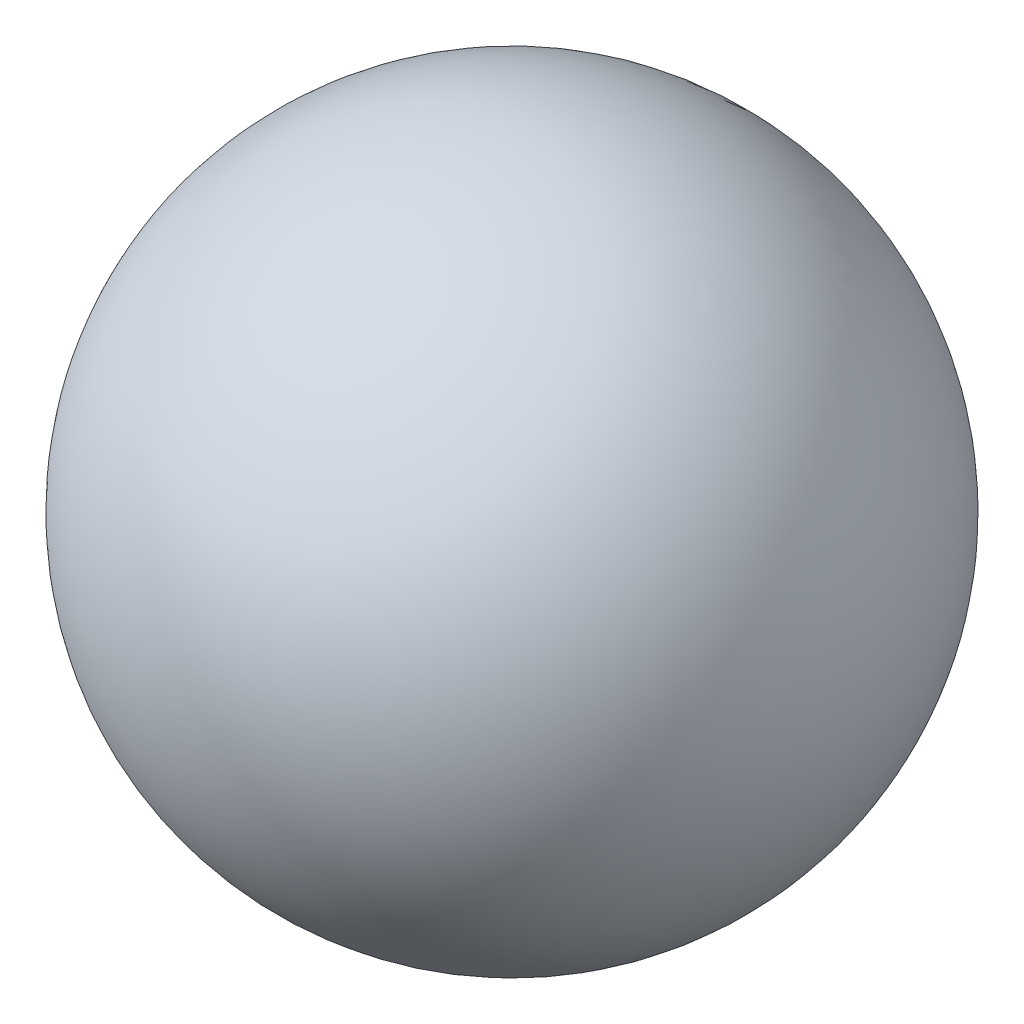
ISO-10303-21;
HEADER;
FILE_DESCRIPTION(('STEP AP214'),'2;1');
FILE_NAME('part.step','',(''),(''),'','','');
FILE_SCHEMA(('AUTOMOTIVE_DESIGN { 1 0 10303 214 1 1 1 1 }'));
ENDSEC;
DATA;
#1=APPLICATION_CONTEXT('core data for automotive mechanical design processes');
#2=APPLICATION_PROTOCOL_DEFINITION('international standard','automotive_design',2000,#1);
#3=PRODUCT_CONTEXT('',#1,'mechanical');
#4=PRODUCT('Part','Part','',(#3));
#5=PRODUCT_RELATED_PRODUCT_CATEGORY('part','',(#4));
#6=PRODUCT_DEFINITION_FORMATION('','',#4);
#7=PRODUCT_DEFINITION_CONTEXT('part definition',#1,'design');
#8=PRODUCT_DEFINITION('design','',#6,#7);
#9=PRODUCT_DEFINITION_SHAPE('','',#8);
#10=(LENGTH_UNIT() NAMED_UNIT(*) SI_UNIT(.MILLI.,.METRE.));
#11=(NAMED_UNIT(*) PLANE_ANGLE_UNIT() SI_UNIT($,.RADIAN.));
#12=(NAMED_UNIT(*) SI_UNIT($,.STERADIAN.) SOLID_ANGLE_UNIT());
#13=UNCERTAINTY_MEASURE_WITH_UNIT(LENGTH_MEASURE(1.E-05),#10,'distance_accuracy_value','');
#14=(GEOMETRIC_REPRESENTATION_CONTEXT(3) GLOBAL_UNCERTAINTY_ASSIGNED_CONTEXT((#13)) GLOBAL_UNIT_ASSIGNED_CONTEXT((#10,
#11,#12)) REPRESENTATION_CONTEXT('',''));
#15=CARTESIAN_POINT('',(0.,0.,0.));
#16=DIRECTION('',(0.,0.,1.));
#17=DIRECTION('',(1.,0.,0.));
#18=AXIS2_PLACEMENT_3D('',#15,#16,#17);
#19=CARTESIAN_POINT('',(-2.5,-5.86537320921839,4.2614430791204));
#20=DIRECTION('',(1.,0.,0.));
#21=DIRECTION('',(0.,0.809016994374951,-0.587785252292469));
#22=AXIS2_PLACEMENT_3D('',#19,#20,#21);
#23=SPHERICAL_SURFACE('',#22,1.25);
#24=CARTESIAN_POINT('',(-3.75,-5.86537320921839,4.2614430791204));
#25=VERTEX_POINT('',#24);
#26=VERTEX_LOOP('',#25);
#27=FACE_BOUND('',#26,.T.);
#28=CARTESIAN_POINT('',(-1.25,-5.86537320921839,4.2614430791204));
#29=VERTEX_POINT('',#28);
#30=VERTEX_LOOP('',#29);
#31=FACE_BOUND('',#30,.T.);
#32=ADVANCED_FACE('F16',(#27,#31),#23,.T.);
#33=CLOSED_SHELL('',(#32));
#34=MANIFOLD_SOLID_BREP('B1',#33);
#35=ADVANCED_BREP_SHAPE_REPRESENTATION('',(#18,#34),#14);
#36=SHAPE_DEFINITION_REPRESENTATION(#9,#35);
ENDSEC;
END-ISO-10303-21;
